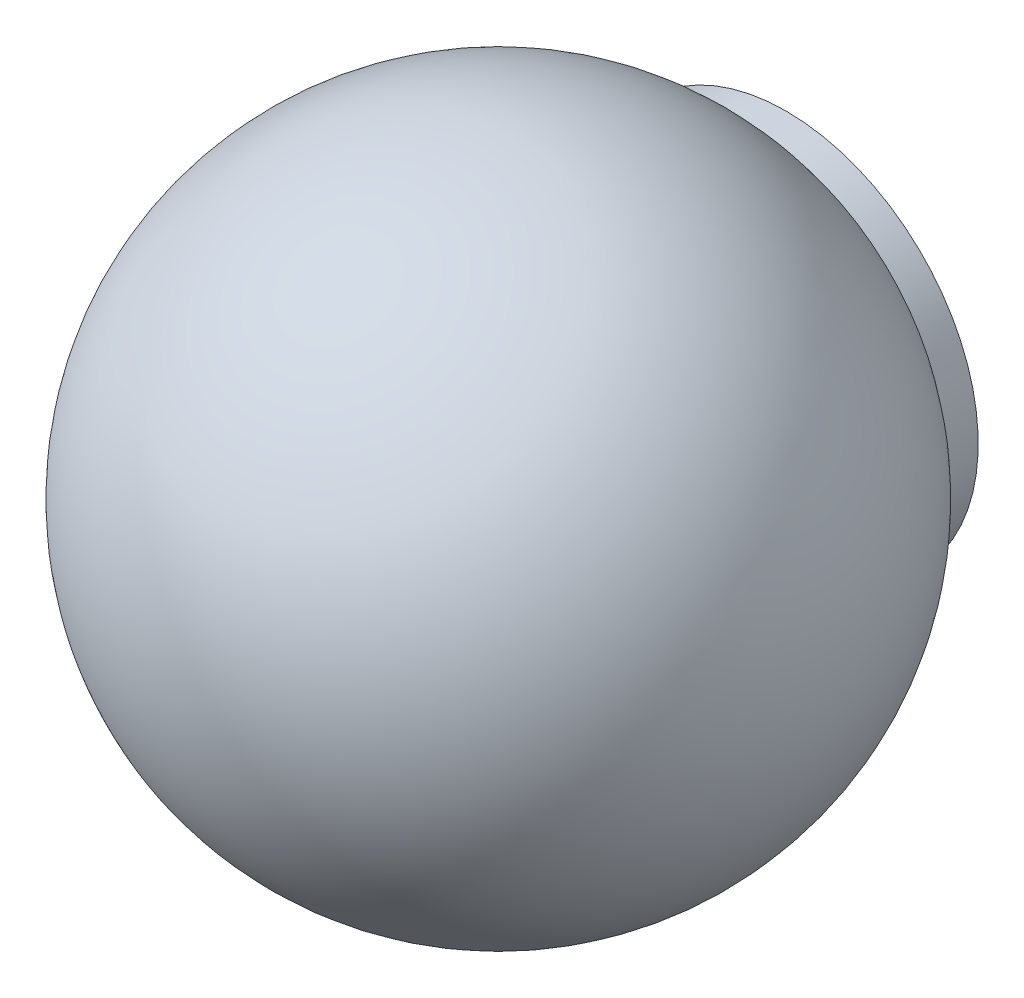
ISO-10303-21;
HEADER;
FILE_DESCRIPTION(('STEP AP214'),'2;1');
FILE_NAME('part.step','',(''),(''),'','','');
FILE_SCHEMA(('AUTOMOTIVE_DESIGN { 1 0 10303 214 1 1 1 1 }'));
ENDSEC;
DATA;
#1=APPLICATION_CONTEXT('core data for automotive mechanical design processes');
#2=APPLICATION_PROTOCOL_DEFINITION('international standard','automotive_design',2000,#1);
#3=PRODUCT_CONTEXT('',#1,'mechanical');
#4=PRODUCT('Part','Part','',(#3));
#5=PRODUCT_RELATED_PRODUCT_CATEGORY('part','',(#4));
#6=PRODUCT_DEFINITION_FORMATION('','',#4);
#7=PRODUCT_DEFINITION_CONTEXT('part definition',#1,'design');
#8=PRODUCT_DEFINITION('design','',#6,#7);
#9=PRODUCT_DEFINITION_SHAPE('','',#8);
#10=(LENGTH_UNIT() NAMED_UNIT(*) SI_UNIT(.MILLI.,.METRE.));
#11=(NAMED_UNIT(*) PLANE_ANGLE_UNIT() SI_UNIT($,.RADIAN.));
#12=(NAMED_UNIT(*) SI_UNIT($,.STERADIAN.) SOLID_ANGLE_UNIT());
#13=UNCERTAINTY_MEASURE_WITH_UNIT(LENGTH_MEASURE(1.E-05),#10,'distance_accuracy_value','');
#14=(GEOMETRIC_REPRESENTATION_CONTEXT(3) GLOBAL_UNCERTAINTY_ASSIGNED_CONTEXT((#13)) GLOBAL_UNIT_ASSIGNED_CONTEXT((#10,
#11,#12)) REPRESENTATION_CONTEXT('',''));
#15=CARTESIAN_POINT('',(0.,0.,0.));
#16=DIRECTION('',(0.,0.,1.));
#17=DIRECTION('',(1.,0.,0.));
#18=AXIS2_PLACEMENT_3D('',#15,#16,#17);
#19=CARTESIAN_POINT('',(0.,0.,9.));
#20=DIRECTION('',(0.,0.,-1.));
#21=DIRECTION('',(-1.,0.,0.));
#22=AXIS2_PLACEMENT_3D('',#19,#20,#21);
#23=SPHERICAL_SURFACE('',#22,10.);
#24=CARTESIAN_POINT('',(0.,0.,0.999999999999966));
#25=DIRECTION('',(0.,0.,-1.));
#26=DIRECTION('',(0.,1.,0.));
#27=AXIS2_PLACEMENT_3D('',#24,#25,#26);
#28=CIRCLE('',#27,6.);
#29=CARTESIAN_POINT('',(0.,6.,0.999999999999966));
#30=VERTEX_POINT('',#29);
#31=EDGE_CURVE('E8',#30,#30,#28,.T.);
#32=ORIENTED_EDGE('',*,*,#31,.F.);
#33=EDGE_LOOP('',(#32));
#34=FACE_BOUND('',#33,.T.);
#35=ADVANCED_FACE('F12',(#34),#23,.T.);
#36=CARTESIAN_POINT('',(0.,0.,-5.));
#37=DIRECTION('',(0.,0.,-1.));
#38=DIRECTION('',(0.,1.,0.));
#39=AXIS2_PLACEMENT_3D('',#36,#37,#38);
#40=CYLINDRICAL_SURFACE('',#39,6.);
#41=CARTESIAN_POINT('',(0.,0.,0.));
#42=DIRECTION('',(0.,0.,-1.));
#43=DIRECTION('',(0.,1.,0.));
#44=AXIS2_PLACEMENT_3D('',#41,#42,#43);
#45=CIRCLE('',#44,6.);
#46=CARTESIAN_POINT('',(0.,6.,0.));
#47=VERTEX_POINT('',#46);
#48=EDGE_CURVE('E18',#47,#47,#45,.T.);
#49=ORIENTED_EDGE('',*,*,#48,.F.);
#50=EDGE_LOOP('',(#49));
#51=FACE_BOUND('',#50,.T.);
#52=ORIENTED_EDGE('',*,*,#31,.T.);
#53=EDGE_LOOP('',(#52));
#54=FACE_BOUND('',#53,.T.);
#55=ADVANCED_FACE('F42',(#51,#54),#40,.T.);
#56=CARTESIAN_POINT('',(-6.,0.,0.));
#57=DIRECTION('',(0.,0.,1.));
#58=DIRECTION('',(0.,-1.,0.));
#59=AXIS2_PLACEMENT_3D('',#56,#57,#58);
#60=PLANE('',#59);
#61=CARTESIAN_POINT('',(0.,0.,0.));
#62=DIRECTION('',(0.,0.,-1.));
#63=DIRECTION('',(0.,1.,0.));
#64=AXIS2_PLACEMENT_3D('',#61,#62,#63);
#65=CIRCLE('',#64,2.5);
#66=CARTESIAN_POINT('',(0.,2.5,0.));
#67=VERTEX_POINT('',#66);
#68=EDGE_CURVE('E22',#67,#67,#65,.T.);
#69=ORIENTED_EDGE('',*,*,#68,.F.);
#70=EDGE_LOOP('',(#69));
#71=FACE_BOUND('',#70,.T.);
#72=ORIENTED_EDGE('',*,*,#48,.T.);
#73=EDGE_LOOP('',(#72));
#74=FACE_BOUND('',#73,.T.);
#75=ADVANCED_FACE('F37',(#71,#74),#60,.F.);
#76=CARTESIAN_POINT('',(0.,0.,-5.));
#77=DIRECTION('',(0.,0.,-1.));
#78=DIRECTION('',(0.,1.,0.));
#79=AXIS2_PLACEMENT_3D('',#76,#77,#78);
#80=CYLINDRICAL_SURFACE('',#79,2.5);
#81=CARTESIAN_POINT('',(0.,0.,10.));
#82=DIRECTION('',(0.,0.,-1.));
#83=DIRECTION('',(0.,1.,0.));
#84=AXIS2_PLACEMENT_3D('',#81,#82,#83);
#85=CIRCLE('',#84,2.5);
#86=CARTESIAN_POINT('',(0.,2.5,10.));
#87=VERTEX_POINT('',#86);
#88=EDGE_CURVE('E26',#87,#87,#85,.T.);
#89=ORIENTED_EDGE('',*,*,#88,.F.);
#90=EDGE_LOOP('',(#89));
#91=FACE_BOUND('',#90,.T.);
#92=ORIENTED_EDGE('',*,*,#68,.T.);
#93=EDGE_LOOP('',(#92));
#94=FACE_BOUND('',#93,.T.);
#95=ADVANCED_FACE('F34',(#91,#94),#80,.F.);
#96=CARTESIAN_POINT('',(-2.5,0.,10.));
#97=DIRECTION('',(0.,0.,1.));
#98=DIRECTION('',(0.,-1.,0.));
#99=AXIS2_PLACEMENT_3D('',#96,#97,#98);
#100=PLANE('',#99);
#101=ORIENTED_EDGE('',*,*,#88,.T.);
#102=EDGE_LOOP('',(#101));
#103=FACE_BOUND('',#102,.T.);
#104=ADVANCED_FACE('F32',(#103),#100,.F.);
#105=CLOSED_SHELL('',(#35,#55,#75,#95,#104));
#106=MANIFOLD_SOLID_BREP('B1',#105);
#107=ADVANCED_BREP_SHAPE_REPRESENTATION('',(#18,#106),#14);
#108=SHAPE_DEFINITION_REPRESENTATION(#9,#107);
ENDSEC;
END-ISO-10303-21;
